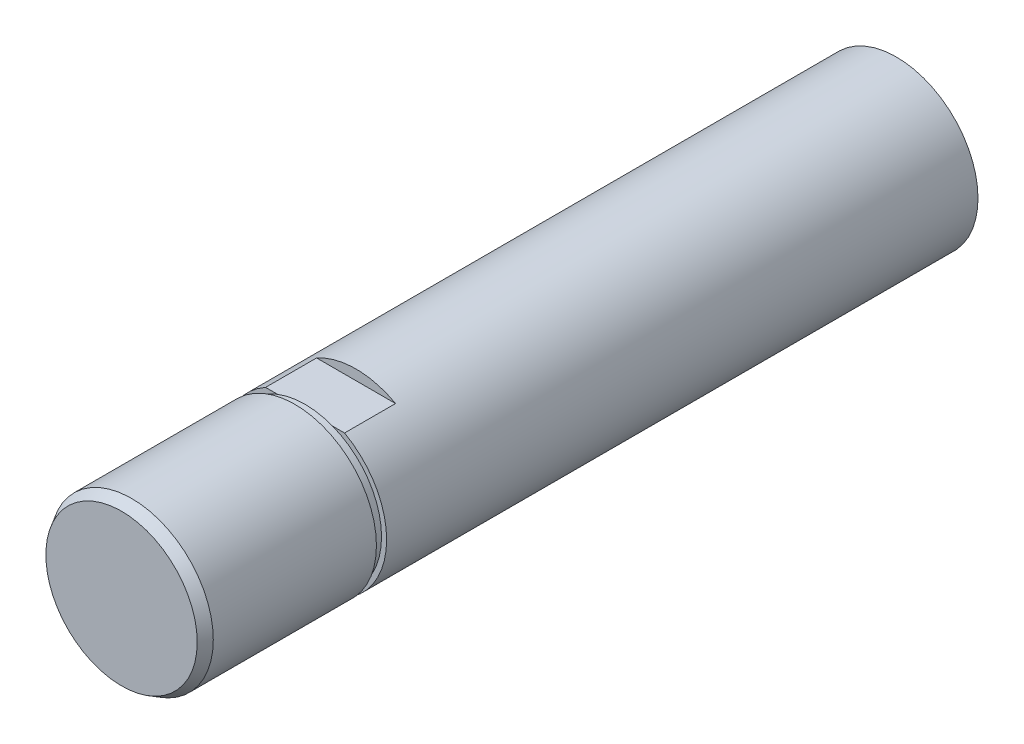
ISO-10303-21;
HEADER;
FILE_DESCRIPTION(('STEP AP214'),'2;1');
FILE_NAME('part.step','',(''),(''),'','','');
FILE_SCHEMA(('AUTOMOTIVE_DESIGN { 1 0 10303 214 1 1 1 1 }'));
ENDSEC;
DATA;
#1=APPLICATION_CONTEXT('core data for automotive mechanical design processes');
#2=APPLICATION_PROTOCOL_DEFINITION('international standard','automotive_design',2000,#1);
#3=PRODUCT_CONTEXT('',#1,'mechanical');
#4=PRODUCT('Part','Part','',(#3));
#5=PRODUCT_RELATED_PRODUCT_CATEGORY('part','',(#4));
#6=PRODUCT_DEFINITION_FORMATION('','',#4);
#7=PRODUCT_DEFINITION_CONTEXT('part definition',#1,'design');
#8=PRODUCT_DEFINITION('design','',#6,#7);
#9=PRODUCT_DEFINITION_SHAPE('','',#8);
#10=(LENGTH_UNIT() NAMED_UNIT(*) SI_UNIT(.MILLI.,.METRE.));
#11=(NAMED_UNIT(*) PLANE_ANGLE_UNIT() SI_UNIT($,.RADIAN.));
#12=(NAMED_UNIT(*) SI_UNIT($,.STERADIAN.) SOLID_ANGLE_UNIT());
#13=UNCERTAINTY_MEASURE_WITH_UNIT(LENGTH_MEASURE(1.E-05),#10,'distance_accuracy_value','');
#14=(GEOMETRIC_REPRESENTATION_CONTEXT(3) GLOBAL_UNCERTAINTY_ASSIGNED_CONTEXT((#13)) GLOBAL_UNIT_ASSIGNED_CONTEXT((#10,
#11,#12)) REPRESENTATION_CONTEXT('',''));
#15=CARTESIAN_POINT('',(0.,0.,0.));
#16=DIRECTION('',(0.,0.,1.));
#17=DIRECTION('',(1.,0.,0.));
#18=AXIS2_PLACEMENT_3D('',#15,#16,#17);
#19=CARTESIAN_POINT('',(0.,0.,8.));
#20=DIRECTION('',(0.,0.,1.));
#21=DIRECTION('',(1.,0.,0.));
#22=AXIS2_PLACEMENT_3D('',#19,#20,#21);
#23=PLANE('',#22);
#24=DIRECTION('',(1.,0.,0.));
#25=VECTOR('',#24,1.);
#26=CARTESIAN_POINT('',(-10.5,-7.,8.));
#27=LINE('',#26,#25);
#28=CARTESIAN_POINT('',(2.69258240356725,-7.,8.));
#29=VERTEX_POINT('',#28);
#30=CARTESIAN_POINT('',(3.87298334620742,-7.,8.));
#31=VERTEX_POINT('',#30);
#32=EDGE_CURVE('E98',#29,#31,#27,.T.);
#33=ORIENTED_EDGE('',*,*,#32,.T.);
#34=CARTESIAN_POINT('',(0.,0.,8.));
#35=DIRECTION('',(0.,0.,1.));
#36=DIRECTION('',(1.,0.,0.));
#37=AXIS2_PLACEMENT_3D('',#34,#35,#36);
#38=CIRCLE('',#37,8.);
#39=CARTESIAN_POINT('',(3.87298334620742,7.,8.));
#40=VERTEX_POINT('',#39);
#41=EDGE_CURVE('E112',#31,#40,#38,.T.);
#42=ORIENTED_EDGE('',*,*,#41,.T.);
#43=DIRECTION('',(1.,0.,0.));
#44=VECTOR('',#43,1.);
#45=CARTESIAN_POINT('',(-10.5,7.,8.));
#46=LINE('',#45,#44);
#47=CARTESIAN_POINT('',(2.69258240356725,7.,8.));
#48=VERTEX_POINT('',#47);
#49=EDGE_CURVE('E146',#48,#40,#46,.T.);
#50=ORIENTED_EDGE('',*,*,#49,.F.);
#51=CARTESIAN_POINT('',(0.,0.,8.));
#52=DIRECTION('',(0.,0.,1.));
#53=DIRECTION('',(1.,0.,0.));
#54=AXIS2_PLACEMENT_3D('',#51,#52,#53);
#55=CIRCLE('',#54,7.5);
#56=EDGE_CURVE('E140',#29,#48,#55,.T.);
#57=ORIENTED_EDGE('',*,*,#56,.F.);
#58=EDGE_LOOP('',(#33,#42,#50,#57));
#59=FACE_BOUND('',#58,.T.);
#60=ADVANCED_FACE('F35',(#59),#23,.T.);
#61=CARTESIAN_POINT('',(0.,0.,-50.));
#62=DIRECTION('',(0.,0.,1.));
#63=DIRECTION('',(1.,0.,0.));
#64=AXIS2_PLACEMENT_3D('',#61,#62,#63);
#65=CYLINDRICAL_SURFACE('',#64,8.);
#66=CARTESIAN_POINT('',(0.,0.,9.));
#67=DIRECTION('',(0.,0.,1.));
#68=DIRECTION('',(1.,0.,0.));
#69=AXIS2_PLACEMENT_3D('',#66,#67,#68);
#70=CIRCLE('',#69,8.);
#71=CARTESIAN_POINT('',(8.,0.,9.));
#72=VERTEX_POINT('',#71);
#73=EDGE_CURVE('E111',#72,#72,#70,.T.);
#74=ORIENTED_EDGE('',*,*,#73,.T.);
#75=EDGE_LOOP('',(#74));
#76=FACE_BOUND('',#75,.T.);
#77=CARTESIAN_POINT('',(0.,0.,25.));
#78=DIRECTION('',(0.,0.,1.));
#79=DIRECTION('',(1.,0.,0.));
#80=AXIS2_PLACEMENT_3D('',#77,#78,#79);
#81=CIRCLE('',#80,8.);
#82=CARTESIAN_POINT('',(8.,0.,25.));
#83=VERTEX_POINT('',#82);
#84=EDGE_CURVE('E125',#83,#83,#81,.F.);
#85=ORIENTED_EDGE('',*,*,#84,.T.);
#86=EDGE_LOOP('',(#85));
#87=FACE_BOUND('',#86,.T.);
#88=ADVANCED_FACE('F176',(#76,#87),#65,.T.);
#89=CARTESIAN_POINT('',(0.,0.,26.));
#90=DIRECTION('',(0.,0.,1.));
#91=DIRECTION('',(1.,0.,0.));
#92=AXIS2_PLACEMENT_3D('',#89,#90,#91);
#93=PLANE('',#92);
#94=CARTESIAN_POINT('',(0.,0.,26.));
#95=DIRECTION('',(0.,0.,1.));
#96=DIRECTION('',(1.,0.,0.));
#97=AXIS2_PLACEMENT_3D('',#94,#95,#96);
#98=CIRCLE('',#97,7.42264973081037);
#99=CARTESIAN_POINT('',(7.42264973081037,0.,26.));
#100=VERTEX_POINT('',#99);
#101=EDGE_CURVE('E122',#100,#100,#98,.T.);
#102=ORIENTED_EDGE('',*,*,#101,.T.);
#103=EDGE_LOOP('',(#102));
#104=FACE_BOUND('',#103,.T.);
#105=ADVANCED_FACE('F181',(#104),#93,.T.);
#106=CARTESIAN_POINT('',(0.,0.,26.));
#107=DIRECTION('',(0.,0.,-1.));
#108=DIRECTION('',(-1.,0.,0.));
#109=AXIS2_PLACEMENT_3D('',#106,#107,#108);
#110=CONICAL_SURFACE('',#109,7.42264973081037,0.523598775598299);
#111=ORIENTED_EDGE('',*,*,#84,.F.);
#112=EDGE_LOOP('',(#111));
#113=FACE_BOUND('',#112,.T.);
#114=ORIENTED_EDGE('',*,*,#101,.F.);
#115=EDGE_LOOP('',(#114));
#116=FACE_BOUND('',#115,.T.);
#117=ADVANCED_FACE('F37',(#113,#116),#110,.T.);
#118=CARTESIAN_POINT('',(0.,0.,9.));
#119=DIRECTION('',(0.,0.,1.));
#120=DIRECTION('',(1.,0.,0.));
#121=AXIS2_PLACEMENT_3D('',#118,#119,#120);
#122=PLANE('',#121);
#123=ORIENTED_EDGE('',*,*,#73,.F.);
#124=EDGE_LOOP('',(#123));
#125=FACE_BOUND('',#124,.T.);
#126=CARTESIAN_POINT('',(0.,0.,9.));
#127=DIRECTION('',(0.,0.,1.));
#128=DIRECTION('',(1.,0.,0.));
#129=AXIS2_PLACEMENT_3D('',#126,#127,#128);
#130=CIRCLE('',#129,7.5);
#131=CARTESIAN_POINT('',(7.5,0.,9.));
#132=VERTEX_POINT('',#131);
#133=EDGE_CURVE('E117',#132,#132,#130,.T.);
#134=ORIENTED_EDGE('',*,*,#133,.T.);
#135=EDGE_LOOP('',(#134));
#136=FACE_BOUND('',#135,.T.);
#137=ADVANCED_FACE('F186',(#125,#136),#122,.F.);
#138=CARTESIAN_POINT('',(-3.87298334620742,-7.,8.));
#139=VERTEX_POINT('',#138);
#140=CARTESIAN_POINT('',(-2.69258240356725,-7.,8.));
#141=VERTEX_POINT('',#140);
#142=EDGE_CURVE('E87',#139,#141,#27,.T.);
#143=ORIENTED_EDGE('',*,*,#142,.T.);
#144=CARTESIAN_POINT('',(-2.69258240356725,7.,8.));
#145=VERTEX_POINT('',#144);
#146=EDGE_CURVE('E150',#145,#141,#55,.T.);
#147=ORIENTED_EDGE('',*,*,#146,.F.);
#148=CARTESIAN_POINT('',(-3.87298334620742,7.,8.));
#149=VERTEX_POINT('',#148);
#150=EDGE_CURVE('E110',#149,#145,#46,.T.);
#151=ORIENTED_EDGE('',*,*,#150,.F.);
#152=EDGE_CURVE('E104',#149,#139,#38,.T.);
#153=ORIENTED_EDGE('',*,*,#152,.T.);
#154=EDGE_LOOP('',(#143,#147,#151,#153));
#155=FACE_BOUND('',#154,.T.);
#156=ADVANCED_FACE('F108',(#155),#23,.T.);
#157=CARTESIAN_POINT('',(0.,0.,9.));
#158=DIRECTION('',(0.,0.,-1.));
#159=DIRECTION('',(-1.,0.,0.));
#160=AXIS2_PLACEMENT_3D('',#157,#158,#159);
#161=CYLINDRICAL_SURFACE('',#160,7.5);
#162=ORIENTED_EDGE('',*,*,#133,.F.);
#163=EDGE_LOOP('',(#162));
#164=FACE_BOUND('',#163,.T.);
#165=EDGE_CURVE('E151',#48,#145,#55,.T.);
#166=ORIENTED_EDGE('',*,*,#165,.T.);
#167=ORIENTED_EDGE('',*,*,#146,.T.);
#168=CARTESIAN_POINT('',(0.,0.,7.99999999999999));
#169=DIRECTION('',(0.,0.,1.));
#170=DIRECTION('',(0.,-1.,0.));
#171=AXIS2_PLACEMENT_3D('',#168,#169,#170);
#172=CIRCLE('',#171,7.5);
#173=EDGE_CURVE('E155',#141,#29,#172,.T.);
#174=ORIENTED_EDGE('',*,*,#173,.T.);
#175=ORIENTED_EDGE('',*,*,#56,.T.);
#176=EDGE_LOOP('',(#166,#167,#174,#175));
#177=FACE_BOUND('',#176,.T.);
#178=ADVANCED_FACE('F161',(#164,#177),#161,.T.);
#179=CARTESIAN_POINT('',(0.,0.,-50.));
#180=DIRECTION('',(0.,0.,1.));
#181=DIRECTION('',(1.,0.,0.));
#182=AXIS2_PLACEMENT_3D('',#179,#180,#181);
#183=PLANE('',#182);
#184=CARTESIAN_POINT('',(0.,0.,-50.));
#185=DIRECTION('',(0.,0.,1.));
#186=DIRECTION('',(1.,0.,0.));
#187=AXIS2_PLACEMENT_3D('',#184,#185,#186);
#188=CIRCLE('',#187,8.);
#189=CARTESIAN_POINT('',(8.,0.,-50.));
#190=VERTEX_POINT('',#189);
#191=EDGE_CURVE('E115',#190,#190,#188,.T.);
#192=ORIENTED_EDGE('',*,*,#191,.F.);
#193=EDGE_LOOP('',(#192));
#194=FACE_BOUND('',#193,.T.);
#195=ADVANCED_FACE('F191',(#194),#183,.F.);
#196=DIRECTION('',(0.,0.,1.));
#197=VECTOR('',#196,1.);
#198=CARTESIAN_POINT('',(-3.87298334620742,-7.,-50.));
#199=LINE('',#198,#197);
#200=CARTESIAN_POINT('',(-3.87298334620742,-7.,2.99999999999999));
#201=VERTEX_POINT('',#200);
#202=EDGE_CURVE('E11',#139,#201,#199,.F.);
#203=ORIENTED_EDGE('',*,*,#202,.F.);
#204=ORIENTED_EDGE('',*,*,#152,.F.);
#205=DIRECTION('',(0.,0.,1.));
#206=VECTOR('',#205,1.);
#207=CARTESIAN_POINT('',(-3.87298334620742,7.,-50.));
#208=LINE('',#207,#206);
#209=CARTESIAN_POINT('',(-3.87298334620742,7.,3.));
#210=VERTEX_POINT('',#209);
#211=EDGE_CURVE('E128',#210,#149,#208,.T.);
#212=ORIENTED_EDGE('',*,*,#211,.F.);
#213=CARTESIAN_POINT('',(0.,0.,3.));
#214=DIRECTION('',(0.,0.,-1.));
#215=DIRECTION('',(-1.,0.,0.));
#216=AXIS2_PLACEMENT_3D('',#213,#214,#215);
#217=CIRCLE('',#216,8.);
#218=CARTESIAN_POINT('',(3.87298334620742,7.,3.));
#219=VERTEX_POINT('',#218);
#220=EDGE_CURVE('E130',#219,#210,#217,.F.);
#221=ORIENTED_EDGE('',*,*,#220,.F.);
#222=DIRECTION('',(0.,0.,1.));
#223=VECTOR('',#222,1.);
#224=CARTESIAN_POINT('',(3.87298334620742,7.,-50.));
#225=LINE('',#224,#223);
#226=EDGE_CURVE('E132',#40,#219,#225,.F.);
#227=ORIENTED_EDGE('',*,*,#226,.F.);
#228=ORIENTED_EDGE('',*,*,#41,.F.);
#229=DIRECTION('',(0.,0.,1.));
#230=VECTOR('',#229,1.);
#231=CARTESIAN_POINT('',(3.87298334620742,-7.,-50.));
#232=LINE('',#231,#230);
#233=CARTESIAN_POINT('',(3.87298334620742,-7.,2.99999999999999));
#234=VERTEX_POINT('',#233);
#235=EDGE_CURVE('E43',#234,#31,#232,.T.);
#236=ORIENTED_EDGE('',*,*,#235,.F.);
#237=CARTESIAN_POINT('',(0.,0.,3.));
#238=DIRECTION('',(0.,0.,-1.));
#239=DIRECTION('',(0.,1.,0.));
#240=AXIS2_PLACEMENT_3D('',#237,#238,#239);
#241=CIRCLE('',#240,8.);
#242=EDGE_CURVE('E106',#201,#234,#241,.F.);
#243=ORIENTED_EDGE('',*,*,#242,.F.);
#244=EDGE_LOOP('',(#203,#204,#212,#221,#227,#228,#236,#243));
#245=FACE_BOUND('',#244,.T.);
#246=ORIENTED_EDGE('',*,*,#191,.T.);
#247=EDGE_LOOP('',(#246));
#248=FACE_BOUND('',#247,.T.);
#249=ADVANCED_FACE('F101',(#245,#248),#65,.T.);
#250=CARTESIAN_POINT('',(-10.5,10.381540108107,8.));
#251=DIRECTION('',(0.,0.,1.));
#252=DIRECTION('',(1.,0.,0.));
#253=AXIS2_PLACEMENT_3D('',#250,#251,#252);
#254=PLANE('',#253);
#255=EDGE_CURVE('E152',#145,#48,#46,.T.);
#256=ORIENTED_EDGE('',*,*,#255,.F.);
#257=ORIENTED_EDGE('',*,*,#165,.F.);
#258=EDGE_LOOP('',(#256,#257));
#259=FACE_BOUND('',#258,.T.);
#260=ADVANCED_FACE('F202',(#259),#254,.F.);
#261=CARTESIAN_POINT('',(-10.5,10.381540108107,3.));
#262=DIRECTION('',(0.,0.,-1.));
#263=DIRECTION('',(-1.,0.,0.));
#264=AXIS2_PLACEMENT_3D('',#261,#262,#263);
#265=PLANE('',#264);
#266=ORIENTED_EDGE('',*,*,#220,.T.);
#267=DIRECTION('',(1.,0.,0.));
#268=VECTOR('',#267,1.);
#269=CARTESIAN_POINT('',(-10.5,7.,3.));
#270=LINE('',#269,#268);
#271=EDGE_CURVE('E56',#210,#219,#270,.T.);
#272=ORIENTED_EDGE('',*,*,#271,.T.);
#273=EDGE_LOOP('',(#266,#272));
#274=FACE_BOUND('',#273,.T.);
#275=ADVANCED_FACE('F148',(#274),#265,.F.);
#276=CARTESIAN_POINT('',(-10.5,7.,8.));
#277=DIRECTION('',(0.,-1.,0.));
#278=DIRECTION('',(0.,0.,-1.));
#279=AXIS2_PLACEMENT_3D('',#276,#277,#278);
#280=PLANE('',#279);
#281=ORIENTED_EDGE('',*,*,#226,.T.);
#282=ORIENTED_EDGE('',*,*,#271,.F.);
#283=ORIENTED_EDGE('',*,*,#211,.T.);
#284=ORIENTED_EDGE('',*,*,#150,.T.);
#285=ORIENTED_EDGE('',*,*,#255,.T.);
#286=ORIENTED_EDGE('',*,*,#49,.T.);
#287=EDGE_LOOP('',(#281,#282,#283,#284,#285,#286));
#288=FACE_BOUND('',#287,.T.);
#289=ADVANCED_FACE('F144',(#288),#280,.F.);
#290=CARTESIAN_POINT('',(-10.5,-7.,8.));
#291=DIRECTION('',(0.,0.,1.));
#292=DIRECTION('',(0.,-1.,0.));
#293=AXIS2_PLACEMENT_3D('',#290,#291,#292);
#294=PLANE('',#293);
#295=EDGE_CURVE('E92',#141,#29,#27,.T.);
#296=ORIENTED_EDGE('',*,*,#295,.T.);
#297=ORIENTED_EDGE('',*,*,#173,.F.);
#298=EDGE_LOOP('',(#296,#297));
#299=FACE_BOUND('',#298,.T.);
#300=ADVANCED_FACE('F164',(#299),#294,.F.);
#301=CARTESIAN_POINT('',(-10.5,-7.,8.));
#302=DIRECTION('',(0.,1.,0.));
#303=DIRECTION('',(0.,0.,1.));
#304=AXIS2_PLACEMENT_3D('',#301,#302,#303);
#305=PLANE('',#304);
#306=ORIENTED_EDGE('',*,*,#202,.T.);
#307=DIRECTION('',(1.,0.,0.));
#308=VECTOR('',#307,1.);
#309=CARTESIAN_POINT('',(-10.5,-7.,3.));
#310=LINE('',#309,#308);
#311=EDGE_CURVE('E49',#201,#234,#310,.T.);
#312=ORIENTED_EDGE('',*,*,#311,.T.);
#313=ORIENTED_EDGE('',*,*,#235,.T.);
#314=ORIENTED_EDGE('',*,*,#32,.F.);
#315=ORIENTED_EDGE('',*,*,#295,.F.);
#316=ORIENTED_EDGE('',*,*,#142,.F.);
#317=EDGE_LOOP('',(#306,#312,#313,#314,#315,#316));
#318=FACE_BOUND('',#317,.T.);
#319=ADVANCED_FACE('F89',(#318),#305,.F.);
#320=CARTESIAN_POINT('',(-10.5,-7.,3.));
#321=DIRECTION('',(0.,0.,-1.));
#322=DIRECTION('',(0.,1.,0.));
#323=AXIS2_PLACEMENT_3D('',#320,#321,#322);
#324=PLANE('',#323);
#325=ORIENTED_EDGE('',*,*,#242,.T.);
#326=ORIENTED_EDGE('',*,*,#311,.F.);
#327=EDGE_LOOP('',(#325,#326));
#328=FACE_BOUND('',#327,.T.);
#329=ADVANCED_FACE('F171',(#328),#324,.F.);
#330=CLOSED_SHELL('',(#60,#88,#105,#117,#137,#156,#178,#195,#249,#260,#275,#289,#300,#319,#329));
#331=MANIFOLD_SOLID_BREP('B2',#330);
#332=ADVANCED_BREP_SHAPE_REPRESENTATION('',(#18,#331),#14);
#333=SHAPE_DEFINITION_REPRESENTATION(#9,#332);
ENDSEC;
END-ISO-10303-21;
